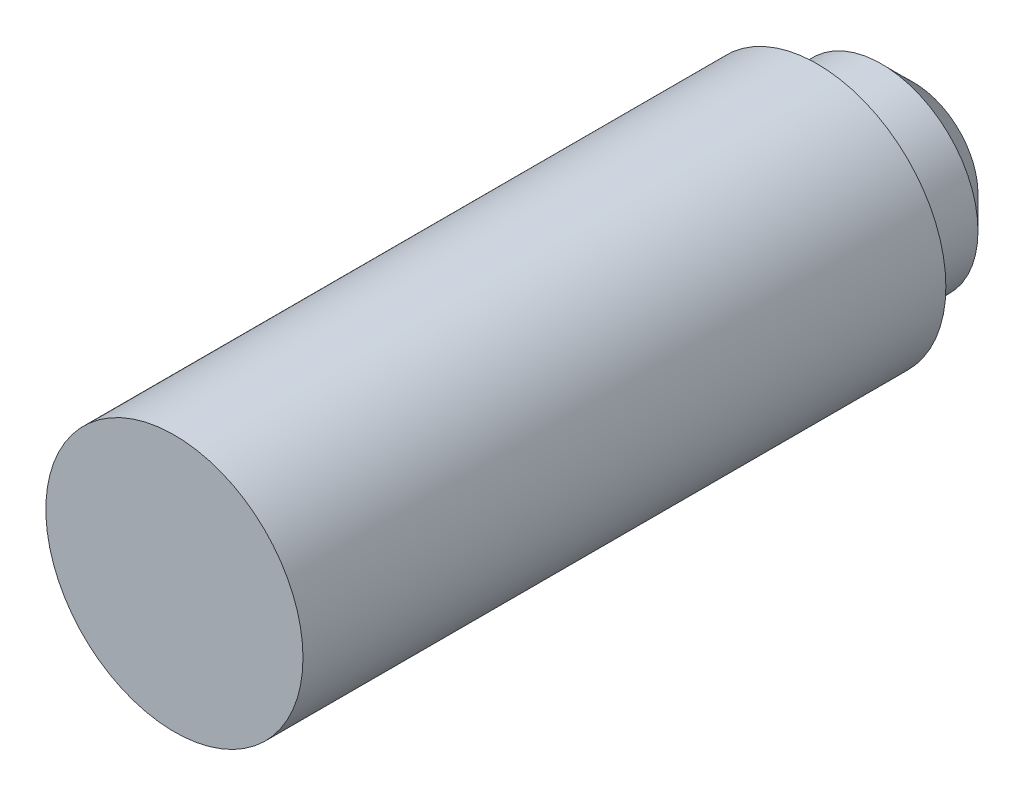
ISO-10303-21;
HEADER;
FILE_DESCRIPTION(('STEP AP214'),'2;1');
FILE_NAME('part.step','',(''),(''),'','','');
FILE_SCHEMA(('AUTOMOTIVE_DESIGN { 1 0 10303 214 1 1 1 1 }'));
ENDSEC;
DATA;
#1=APPLICATION_CONTEXT('core data for automotive mechanical design processes');
#2=APPLICATION_PROTOCOL_DEFINITION('international standard','automotive_design',2000,#1);
#3=PRODUCT_CONTEXT('',#1,'mechanical');
#4=PRODUCT('Part','Part','',(#3));
#5=PRODUCT_RELATED_PRODUCT_CATEGORY('part','',(#4));
#6=PRODUCT_DEFINITION_FORMATION('','',#4);
#7=PRODUCT_DEFINITION_CONTEXT('part definition',#1,'design');
#8=PRODUCT_DEFINITION('design','',#6,#7);
#9=PRODUCT_DEFINITION_SHAPE('','',#8);
#10=(LENGTH_UNIT() NAMED_UNIT(*) SI_UNIT(.MILLI.,.METRE.));
#11=(NAMED_UNIT(*) PLANE_ANGLE_UNIT() SI_UNIT($,.RADIAN.));
#12=(NAMED_UNIT(*) SI_UNIT($,.STERADIAN.) SOLID_ANGLE_UNIT());
#13=UNCERTAINTY_MEASURE_WITH_UNIT(LENGTH_MEASURE(1.E-05),#10,'distance_accuracy_value','');
#14=(GEOMETRIC_REPRESENTATION_CONTEXT(3) GLOBAL_UNCERTAINTY_ASSIGNED_CONTEXT((#13)) GLOBAL_UNIT_ASSIGNED_CONTEXT((#10,
#11,#12)) REPRESENTATION_CONTEXT('',''));
#15=CARTESIAN_POINT('',(0.,0.,0.));
#16=DIRECTION('',(0.,0.,1.));
#17=DIRECTION('',(1.,0.,0.));
#18=AXIS2_PLACEMENT_3D('',#15,#16,#17);
#19=CARTESIAN_POINT('',(0.,0.,3.));
#20=DIRECTION('',(0.,0.,-1.));
#21=DIRECTION('',(-1.,0.,0.));
#22=AXIS2_PLACEMENT_3D('',#19,#20,#21);
#23=CYLINDRICAL_SURFACE('',#22,3.);
#24=CARTESIAN_POINT('',(0.,0.,0.999999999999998));
#25=DIRECTION('',(0.,0.,1.));
#26=DIRECTION('',(1.,0.,0.));
#27=AXIS2_PLACEMENT_3D('',#24,#25,#26);
#28=CIRCLE('',#27,3.);
#29=CARTESIAN_POINT('',(3.,0.,0.999999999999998));
#30=VERTEX_POINT('',#29);
#31=EDGE_CURVE('E44',#30,#30,#28,.T.);
#32=ORIENTED_EDGE('',*,*,#31,.T.);
#33=EDGE_LOOP('',(#32));
#34=FACE_BOUND('',#33,.T.);
#35=CARTESIAN_POINT('',(0.,0.,3.));
#36=DIRECTION('',(0.,0.,1.));
#37=DIRECTION('',(1.,0.,0.));
#38=AXIS2_PLACEMENT_3D('',#35,#36,#37);
#39=CIRCLE('',#38,3.);
#40=CARTESIAN_POINT('',(3.,0.,3.));
#41=VERTEX_POINT('',#40);
#42=EDGE_CURVE('E48',#41,#41,#39,.T.);
#43=ORIENTED_EDGE('',*,*,#42,.F.);
#44=EDGE_LOOP('',(#43));
#45=FACE_BOUND('',#44,.T.);
#46=ADVANCED_FACE('F36',(#34,#45),#23,.T.);
#47=CARTESIAN_POINT('',(0.,0.,0.));
#48=DIRECTION('',(0.,0.,1.));
#49=DIRECTION('',(1.,0.,0.));
#50=AXIS2_PLACEMENT_3D('',#47,#48,#49);
#51=PLANE('',#50);
#52=CARTESIAN_POINT('',(0.,0.,0.));
#53=DIRECTION('',(0.,0.,1.));
#54=DIRECTION('',(1.,0.,0.));
#55=AXIS2_PLACEMENT_3D('',#52,#53,#54);
#56=CIRCLE('',#55,2.);
#57=CARTESIAN_POINT('',(2.,0.,0.));
#58=VERTEX_POINT('',#57);
#59=EDGE_CURVE('E10',#58,#58,#56,.F.);
#60=ORIENTED_EDGE('',*,*,#59,.T.);
#61=EDGE_LOOP('',(#60));
#62=FACE_BOUND('',#61,.T.);
#63=ADVANCED_FACE('F66',(#62),#51,.F.);
#64=CARTESIAN_POINT('',(0.,0.,23.));
#65=DIRECTION('',(0.,0.,-1.));
#66=DIRECTION('',(-1.,0.,0.));
#67=AXIS2_PLACEMENT_3D('',#64,#65,#66);
#68=CYLINDRICAL_SURFACE('',#67,4.);
#69=CARTESIAN_POINT('',(0.,0.,23.));
#70=DIRECTION('',(0.,0.,1.));
#71=DIRECTION('',(1.,0.,0.));
#72=AXIS2_PLACEMENT_3D('',#69,#70,#71);
#73=CIRCLE('',#72,4.);
#74=CARTESIAN_POINT('',(4.,0.,23.));
#75=VERTEX_POINT('',#74);
#76=EDGE_CURVE('E52',#75,#75,#73,.T.);
#77=ORIENTED_EDGE('',*,*,#76,.F.);
#78=EDGE_LOOP('',(#77));
#79=FACE_BOUND('',#78,.T.);
#80=CARTESIAN_POINT('',(0.,0.,3.));
#81=DIRECTION('',(0.,0.,1.));
#82=DIRECTION('',(1.,0.,0.));
#83=AXIS2_PLACEMENT_3D('',#80,#81,#82);
#84=CIRCLE('',#83,4.);
#85=CARTESIAN_POINT('',(4.,0.,3.));
#86=VERTEX_POINT('',#85);
#87=EDGE_CURVE('E55',#86,#86,#84,.T.);
#88=ORIENTED_EDGE('',*,*,#87,.T.);
#89=EDGE_LOOP('',(#88));
#90=FACE_BOUND('',#89,.T.);
#91=ADVANCED_FACE('F63',(#79,#90),#68,.T.);
#92=CARTESIAN_POINT('',(0.,0.,23.));
#93=DIRECTION('',(0.,0.,1.));
#94=DIRECTION('',(1.,0.,0.));
#95=AXIS2_PLACEMENT_3D('',#92,#93,#94);
#96=PLANE('',#95);
#97=ORIENTED_EDGE('',*,*,#76,.T.);
#98=EDGE_LOOP('',(#97));
#99=FACE_BOUND('',#98,.T.);
#100=ADVANCED_FACE('F61',(#99),#96,.T.);
#101=CARTESIAN_POINT('',(0.,0.,3.));
#102=DIRECTION('',(0.,0.,1.));
#103=DIRECTION('',(1.,0.,0.));
#104=AXIS2_PLACEMENT_3D('',#101,#102,#103);
#105=PLANE('',#104);
#106=ORIENTED_EDGE('',*,*,#42,.T.);
#107=EDGE_LOOP('',(#106));
#108=FACE_BOUND('',#107,.T.);
#109=ORIENTED_EDGE('',*,*,#87,.F.);
#110=EDGE_LOOP('',(#109));
#111=FACE_BOUND('',#110,.T.);
#112=ADVANCED_FACE('F70',(#108,#111),#105,.F.);
#113=CARTESIAN_POINT('',(0.,0.,0.999999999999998));
#114=DIRECTION('',(0.,0.,1.));
#115=DIRECTION('',(1.,0.,0.));
#116=AXIS2_PLACEMENT_3D('',#113,#114,#115);
#117=CONICAL_SURFACE('',#116,3.,0.78539816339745);
#118=ORIENTED_EDGE('',*,*,#59,.F.);
#119=EDGE_LOOP('',(#118));
#120=FACE_BOUND('',#119,.T.);
#121=ORIENTED_EDGE('',*,*,#31,.F.);
#122=EDGE_LOOP('',(#121));
#123=FACE_BOUND('',#122,.T.);
#124=ADVANCED_FACE('F39',(#120,#123),#117,.T.);
#125=CLOSED_SHELL('',(#46,#63,#91,#100,#112,#124));
#126=MANIFOLD_SOLID_BREP('B2',#125);
#127=ADVANCED_BREP_SHAPE_REPRESENTATION('',(#18,#126),#14);
#128=SHAPE_DEFINITION_REPRESENTATION(#9,#127);
ENDSEC;
END-ISO-10303-21;
